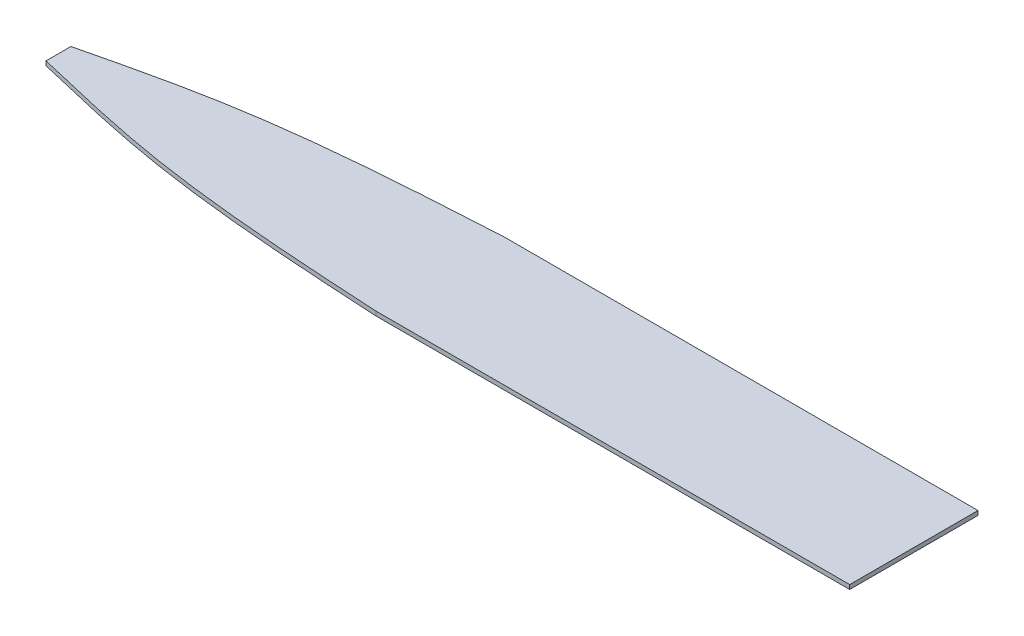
from build123d import *

# Parameters (mm, degrees)
LINEAR_AUSTRAGEN1_DEPTH = 1


with BuildPart() as part:
    # Skizze1 → Linear austragen1 (new body)
    with BuildSketch(Plane(origin=(0, 0, 0), x_dir=(1, 0, 0), z_dir=(0, 1, 0))):
        with BuildLine():
            Line((-100.84727108, -2.913928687), (-100.84727108, 2.913928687))
            add(Edge.make_bspline(
                [(-100.84727108, 2.913928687), (-91.668555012, 5.11545057), (-62.411073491, 12.132879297), (-32.312027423, 13.833145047), (-11.655714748, 15)],
                knots=[0, 0, 0, 0, 0.313722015, 1, 1, 1, 1], degree=3))
            Line((-11.655714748, 15), (99.15272892, 15))
            Line((99.15272892, 15), (99.15272892, -15))
            Line((99.15272892, -15), (-11.655714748, -15))
            add(Edge.make_bspline(
                [(-100.84727108, -2.913928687), (-91.668555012, -5.11545057), (-62.411073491, -12.132879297), (-32.312027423, -13.833145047), (-11.655714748, -15)],
                knots=[0, 0, 0, 0, 0.313722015, 1, 1, 1, 1], degree=3))
        make_face()
    extrude(amount=LINEAR_AUSTRAGEN1_DEPTH)


solid = part.part
